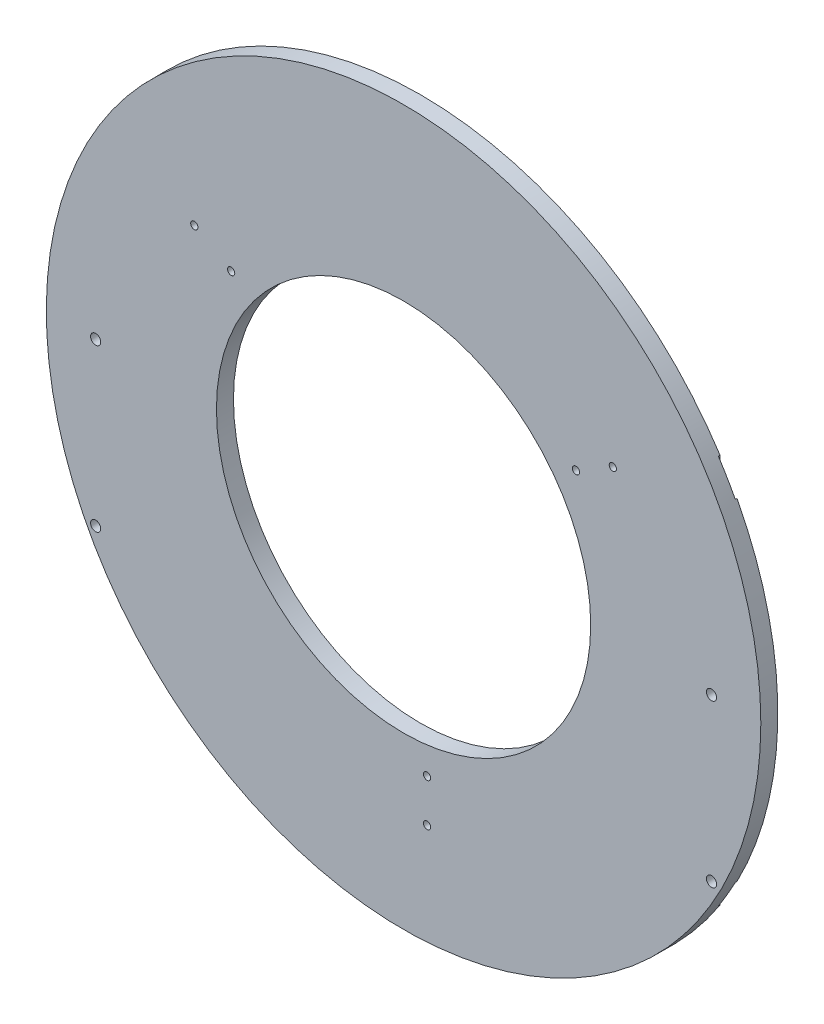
from build123d import *

# Parameters (mm, degrees)
SKETCH1_R                 = 133.35
SKETCH1_R_2               = 69.85
BOSS_EXTRUDE1_DEPTH       = 6.35
F_6_CLEARANCE_HOLE1_D     = 3.7973
SKETCH4_W                 = 6.35
SKETCH4_H                 = 145.491235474
CUT_EXTRUDE1_DEPTH        = 0.635
F_6_32_TAPPED_HOLE1_D     = 2.7051
F_6_32_TAPPED_HOLE1_DEPTH = 10.9728
F_6_32_TAPPED_HOLE1_TIP   = 0.81269403


with BuildPart() as part:
    # Sketch1 → Boss-Extrude1 (new body)
    with BuildSketch(Plane.XY):
        Circle(SKETCH1_R)
        Circle(SKETCH1_R_2, mode=Mode.SUBTRACT)
    extrude(amount=BOSS_EXTRUDE1_DEPTH)

    # 6 Clearance Hole1 (through all)
    with Locations(Plane.XY.offset(6.35)):
        with Locations((-114.935, 0), (114.935, 0), (-114.935, -60.325), (114.935, -60.325)):
            Hole(F_6_CLEARANCE_HOLE1_D / 2)

    # Sketch4 → Cut-Extrude1 (cut)
    with BuildSketch(Plane(origin=(0, 0, 0), x_dir=(-1, 0, 0), z_dir=(0, 0, -1))):
        with Locations((-114.935, 0)):
            Rectangle(SKETCH4_W, SKETCH4_H)
        with Locations((114.935, 0)):
            Rectangle(SKETCH4_W, SKETCH4_H)
    extrude(amount=-CUT_EXTRUDE1_DEPTH, mode=Mode.SUBTRACT)

    # 6-32 Tapped Hole1
    with Locations(Plane.XY.offset(6.35)):
        with Locations((8.763, -79.375), (8.763, -95.25), (64.359266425, 47.276480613), (78.10741971, 55.213980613), (0, 0), (-78.10741971, 55.213980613), (-64.359266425, 47.276480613)):
            Hole(F_6_32_TAPPED_HOLE1_D / 2, depth=F_6_32_TAPPED_HOLE1_DEPTH)
            with Locations((0, 0, -(F_6_32_TAPPED_HOLE1_DEPTH + F_6_32_TAPPED_HOLE1_TIP / 2))):  # 118° drill point
                Cone(0, F_6_32_TAPPED_HOLE1_D / 2, F_6_32_TAPPED_HOLE1_TIP, mode=Mode.SUBTRACT)


solid = part.part
